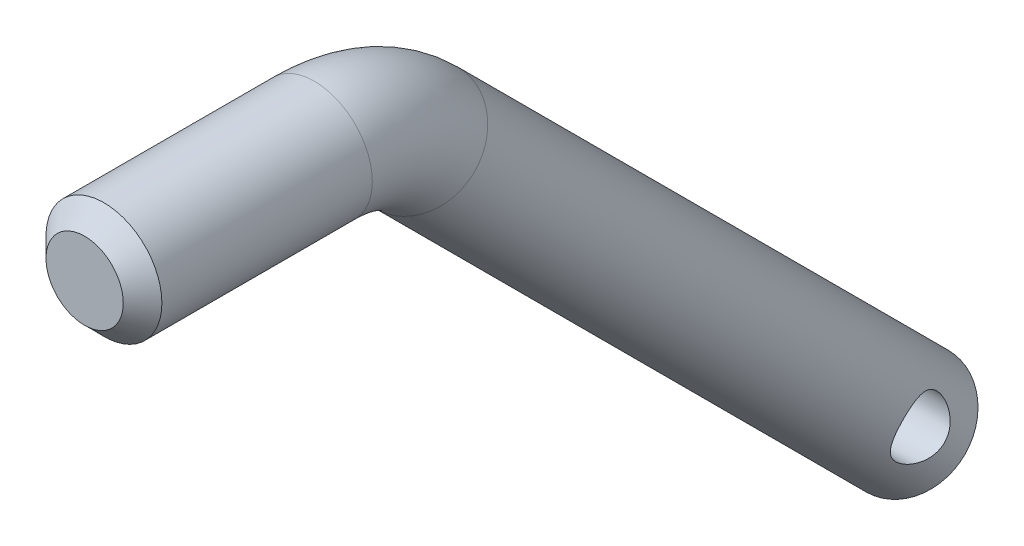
ISO-10303-21;
HEADER;
FILE_DESCRIPTION(('STEP AP214'),'2;1');
FILE_NAME('part.step','',(''),(''),'','','');
FILE_SCHEMA(('AUTOMOTIVE_DESIGN { 1 0 10303 214 1 1 1 1 }'));
ENDSEC;
DATA;
#1=APPLICATION_CONTEXT('core data for automotive mechanical design processes');
#2=APPLICATION_PROTOCOL_DEFINITION('international standard','automotive_design',2000,#1);
#3=PRODUCT_CONTEXT('',#1,'mechanical');
#4=PRODUCT('Part','Part','',(#3));
#5=PRODUCT_RELATED_PRODUCT_CATEGORY('part','',(#4));
#6=PRODUCT_DEFINITION_FORMATION('','',#4);
#7=PRODUCT_DEFINITION_CONTEXT('part definition',#1,'design');
#8=PRODUCT_DEFINITION('design','',#6,#7);
#9=PRODUCT_DEFINITION_SHAPE('','',#8);
#10=(LENGTH_UNIT() NAMED_UNIT(*) SI_UNIT(.MILLI.,.METRE.));
#11=(NAMED_UNIT(*) PLANE_ANGLE_UNIT() SI_UNIT($,.RADIAN.));
#12=(NAMED_UNIT(*) SI_UNIT($,.STERADIAN.) SOLID_ANGLE_UNIT());
#13=UNCERTAINTY_MEASURE_WITH_UNIT(LENGTH_MEASURE(1.E-05),#10,'distance_accuracy_value','');
#14=(GEOMETRIC_REPRESENTATION_CONTEXT(3) GLOBAL_UNCERTAINTY_ASSIGNED_CONTEXT((#13)) GLOBAL_UNIT_ASSIGNED_CONTEXT((#10,
#11,#12)) REPRESENTATION_CONTEXT('',''));
#15=CARTESIAN_POINT('',(0.,0.,0.));
#16=DIRECTION('',(0.,0.,1.));
#17=DIRECTION('',(1.,0.,0.));
#18=AXIS2_PLACEMENT_3D('',#15,#16,#17);
#19=CARTESIAN_POINT('',(0.,-4.39339828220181,-34.3933982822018));
#20=DIRECTION('',(0.,-0.707106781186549,-0.707106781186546));
#21=DIRECTION('',(0.,0.707106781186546,-0.707106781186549));
#22=AXIS2_PLACEMENT_3D('',#19,#20,#21);
#23=CYLINDRICAL_SURFACE('',#22,6.);
#24=CARTESIAN_POINT('',(-5.61248608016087,-50.9116882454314,-83.9116882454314));
#25=CARTESIAN_POINT('',(-5.56800915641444,-50.7452780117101,-83.9116858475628));
#26=CARTESIAN_POINT('',(-5.52298636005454,-50.5788502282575,-83.897831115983));
#27=CARTESIAN_POINT('',(-5.43657178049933,-50.2493962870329,-83.8424462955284));
#28=CARTESIAN_POINT('',(-5.39518680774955,-50.0863769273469,-83.8008654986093));
#29=CARTESIAN_POINT('',(-5.32094594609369,-49.7670443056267,-83.6898980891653));
#30=CARTESIAN_POINT('',(-5.28812794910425,-49.6107633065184,-83.6203912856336));
#31=CARTESIAN_POINT('',(-5.23616223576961,-49.3107713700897,-83.4545863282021));
#32=CARTESIAN_POINT('',(-5.21699214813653,-49.1670402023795,-83.3583323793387));
#33=CARTESIAN_POINT('',(-5.19653028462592,-48.9097269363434,-83.1515309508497));
#34=CARTESIAN_POINT('',(-5.19378205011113,-48.7945948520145,-83.043055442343));
#35=CARTESIAN_POINT('',(-5.20269225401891,-48.5830714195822,-82.8096709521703));
#36=CARTESIAN_POINT('',(-5.2143509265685,-48.4866803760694,-82.6847617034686));
#37=CARTESIAN_POINT('',(-5.24911403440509,-48.320977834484,-82.4314358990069));
#38=CARTESIAN_POINT('',(-5.27141447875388,-48.2503014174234,-82.30379152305));
#39=CARTESIAN_POINT('',(-5.3244192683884,-48.1286385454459,-82.0411144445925));
#40=CARTESIAN_POINT('',(-5.35512618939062,-48.077658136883,-81.9060794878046));
#41=CARTESIAN_POINT('',(-5.42500703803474,-47.9919474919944,-81.6185612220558));
#42=CARTESIAN_POINT('',(-5.4647031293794,-47.9591724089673,-81.4656240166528));
#43=CARTESIAN_POINT('',(-5.54650132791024,-47.9176898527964,-81.1571075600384));
#44=CARTESIAN_POINT('',(-5.5886049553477,-47.9089977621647,-81.0015266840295));
#45=CARTESIAN_POINT('',(-5.67594322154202,-47.9161900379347,-80.6734679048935));
#46=CARTESIAN_POINT('',(-5.72101814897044,-47.9348598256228,-80.5009988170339));
#47=CARTESIAN_POINT('',(-5.8046239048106,-48.0021270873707,-80.160302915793));
#48=CARTESIAN_POINT('',(-5.84315550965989,-48.0507210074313,-79.9920756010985));
#49=CARTESIAN_POINT('',(-5.90863725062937,-48.1760397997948,-79.6684533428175));
#50=CARTESIAN_POINT('',(-5.93582886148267,-48.2521058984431,-79.5128546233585));
#51=CARTESIAN_POINT('',(-5.976664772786,-48.430914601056,-79.215890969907));
#52=CARTESIAN_POINT('',(-5.99032093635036,-48.5336337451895,-79.0745136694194));
#53=CARTESIAN_POINT('',(-6.00181964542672,-48.7509346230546,-78.8246405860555));
#54=CARTESIAN_POINT('',(-6.00111142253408,-48.8632919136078,-78.7142688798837));
#55=CARTESIAN_POINT('',(-5.98748453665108,-49.1034372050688,-78.5127752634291));
#56=CARTESIAN_POINT('',(-5.97456717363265,-49.2312235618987,-78.4216513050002));
#57=CARTESIAN_POINT('',(-5.93841748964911,-49.4939533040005,-78.2635171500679));
#58=CARTESIAN_POINT('',(-5.91552482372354,-49.6285418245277,-78.1958346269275));
#59=CARTESIAN_POINT('',(-5.8615609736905,-49.9048634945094,-78.0817297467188));
#60=CARTESIAN_POINT('',(-5.83048800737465,-50.0465981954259,-78.0353120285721));
#61=CARTESIAN_POINT('',(-5.76026829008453,-50.3444348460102,-77.9615297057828));
#62=CARTESIAN_POINT('',(-5.72070096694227,-50.5008359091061,-77.9357800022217));
#63=CARTESIAN_POINT('',(-5.63861733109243,-50.8150365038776,-77.9090983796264));
#64=CARTESIAN_POINT('',(-5.59609896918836,-50.9728369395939,-77.9081838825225));
#65=CARTESIAN_POINT('',(-5.50803785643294,-51.3015042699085,-77.932145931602));
#66=CARTESIAN_POINT('',(-5.46258113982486,-51.4722229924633,-77.9594266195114));
#67=CARTESIAN_POINT('',(-5.37808394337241,-51.8080885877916,-78.0435254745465));
#68=CARTESIAN_POINT('',(-5.33904289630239,-51.9732359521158,-78.1003410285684));
#69=CARTESIAN_POINT('',(-5.28973228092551,-52.2115139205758,-78.2065338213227));
#70=CARTESIAN_POINT('',(-5.27493057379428,-52.2887101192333,-78.2449876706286));
#71=CARTESIAN_POINT('',(-5.24876772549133,-52.4399261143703,-78.3286777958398));
#72=CARTESIAN_POINT('',(-5.2374047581,-52.5139475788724,-78.3739104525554));
#73=CARTESIAN_POINT('',(-5.21861863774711,-52.6580632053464,-78.4708469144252));
#74=CARTESIAN_POINT('',(-5.21119183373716,-52.728160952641,-78.5225446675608));
#75=CARTESIAN_POINT('',(-5.20059284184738,-52.8637639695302,-78.631994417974));
#76=CARTESIAN_POINT('',(-5.19742004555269,-52.9292698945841,-78.6897455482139));
#77=CARTESIAN_POINT('',(-5.19480420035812,-53.1019756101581,-78.8560129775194));
#78=CARTESIAN_POINT('',(-5.19990579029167,-53.2038468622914,-78.9702751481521));
#79=CARTESIAN_POINT('',(-5.22295685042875,-53.3884667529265,-79.2120522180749));
#80=CARTESIAN_POINT('',(-5.24090904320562,-53.4712113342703,-79.3395699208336));
#81=CARTESIAN_POINT('',(-5.28669122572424,-53.6142282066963,-79.6009773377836));
#82=CARTESIAN_POINT('',(-5.31428138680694,-53.6749790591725,-79.734649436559));
#83=CARTESIAN_POINT('',(-5.37637381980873,-53.7760389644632,-80.0079457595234));
#84=CARTESIAN_POINT('',(-5.41087850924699,-53.816340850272,-80.1475720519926));
#85=CARTESIAN_POINT('',(-5.48786104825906,-53.8798504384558,-80.4468482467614));
#86=CARTESIAN_POINT('',(-5.530799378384,-53.9004961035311,-80.6069246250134));
#87=CARTESIAN_POINT('',(-5.61698672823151,-53.9159575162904,-80.9283085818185));
#88=CARTESIAN_POINT('',(-5.66023592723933,-53.9107569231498,-81.089616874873));
#89=CARTESIAN_POINT('',(-5.74636982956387,-53.8728644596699,-81.4234338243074));
#90=CARTESIAN_POINT('',(-5.78893714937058,-53.8379651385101,-81.5957830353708));
#91=CARTESIAN_POINT('',(-5.86495840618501,-53.7377774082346,-81.9335491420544));
#92=CARTESIAN_POINT('',(-5.89841693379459,-53.6725043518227,-82.098969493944));
#93=CARTESIAN_POINT('',(-5.95072289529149,-53.5171912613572,-82.4081962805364));
#94=CARTESIAN_POINT('',(-5.97029953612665,-53.4287902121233,-82.552698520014));
#95=CARTESIAN_POINT('',(-5.99558015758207,-53.2281882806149,-82.8254341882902));
#96=CARTESIAN_POINT('',(-6.0012947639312,-53.1160056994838,-82.9536800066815));
#97=CARTESIAN_POINT('',(-5.99834900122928,-52.8832072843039,-83.1781342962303));
#98=CARTESIAN_POINT('',(-5.99098892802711,-52.7643744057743,-83.2762208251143));
#99=CARTESIAN_POINT('',(-5.96509461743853,-52.5139080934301,-83.4526244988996));
#100=CARTESIAN_POINT('',(-5.94655669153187,-52.3822704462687,-83.5309351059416));
#101=CARTESIAN_POINT('',(-5.90006065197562,-52.1101035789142,-83.6661228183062));
#102=CARTESIAN_POINT('',(-5.87210525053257,-51.9695769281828,-83.7230060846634));
#103=CARTESIAN_POINT('',(-5.80922706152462,-51.683155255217,-83.8146908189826));
#104=CARTESIAN_POINT('',(-5.77431103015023,-51.5372655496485,-83.8495135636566));
#105=CARTESIAN_POINT('',(-5.71741888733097,-51.3109105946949,-83.886093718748));
#106=CARTESIAN_POINT('',(-5.69688940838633,-51.2312589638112,-83.8956932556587));
#107=CARTESIAN_POINT('',(-5.65511066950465,-51.0716356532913,-83.9084910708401));
#108=CARTESIAN_POINT('',(-5.6338614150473,-50.9916639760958,-83.9116893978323));
#109=CARTESIAN_POINT('',(-5.61248608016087,-50.9116882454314,-83.9116882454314));
#110=B_SPLINE_CURVE_WITH_KNOTS('',3,(#24,#25,#26,#27,#28,#29,#30,#31,#32,#33,#34,#35,#36,#37,
#38,#39,#40,#41,#42,#43,#44,#45,#46,#47,#48,#49,#50,#51,#52,#53,#54,#55,#56,#57,#58,#59,#60,#61,
#62,#63,#64,#65,#66,#67,#68,#69,#70,#71,#72,#73,#74,#75,#76,#77,#78,#79,#80,#81,#82,#83,#84,#85,
#86,#87,#88,#89,#90,#91,#92,#93,#94,#95,#96,#97,#98,#99,#100,#101,#102,#103,#104,#105,#106,#107,
#108,#109),.UNSPECIFIED.,.T.,.F.,(4,2,2,2,2,2,2,2,2,2,2,2,2,2,2,2,2,2,2,2,2,2,2,2,2,2,2,2,2,2,2,
2,2,2,2,2,2,2,2,2,2,2,4),(0.,0.516474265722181,1.03389570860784,1.55356835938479,
2.07238720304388,2.5444156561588,3.01645178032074,3.45741403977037,3.89851156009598,
4.38068183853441,4.86316002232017,5.39828877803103,5.93335399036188,6.45635858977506,
6.9789043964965,7.44901855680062,7.91908266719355,8.37425881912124,8.82953422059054,
9.31763273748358,9.80607364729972,10.3398956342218,10.8736703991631,11.1358633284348,
11.3979167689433,11.659726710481,11.9214992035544,12.3784468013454,12.8354912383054,
13.2818895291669,13.7284441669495,14.2274194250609,14.7267101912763,15.2667204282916,
15.8064580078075,16.3151761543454,16.8235042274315,17.2840669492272,17.7447817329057,
18.2053639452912,18.6655012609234,18.9137174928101,19.1619318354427),.UNSPECIFIED.);
#111=CARTESIAN_POINT('',(-5.61248608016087,-50.9116882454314,-83.9116882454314));
#112=VERTEX_POINT('',#111);
#113=EDGE_CURVE('E31',#112,#112,#110,.T.);
#114=ORIENTED_EDGE('',*,*,#113,.T.);
#115=EDGE_LOOP('',(#114));
#116=FACE_BOUND('',#115,.T.);
#117=CARTESIAN_POINT('',(5.61248608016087,-50.9116882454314,-83.9116882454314));
#118=CARTESIAN_POINT('',(5.65646371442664,-51.07624771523,-83.9116850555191));
#119=CARTESIAN_POINT('',(5.69998667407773,-51.2410879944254,-83.8981357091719));
#120=CARTESIAN_POINT('',(5.78185000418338,-51.5677675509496,-83.8437567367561));
#121=CARTESIAN_POINT('',(5.82018299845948,-51.7296022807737,-83.8028887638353));
#122=CARTESIAN_POINT('',(5.88788660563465,-52.0465806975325,-83.6938065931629));
#123=CARTESIAN_POINT('',(5.91722380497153,-52.2016976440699,-83.6254925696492));
#124=CARTESIAN_POINT('',(5.96347847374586,-52.4994800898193,-83.4626973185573));
#125=CARTESIAN_POINT('',(5.9804085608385,-52.6421581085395,-83.3682428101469));
#126=CARTESIAN_POINT('',(5.99918031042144,-52.9001464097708,-83.1636077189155));
#127=CARTESIAN_POINT('',(6.00203294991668,-53.016694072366,-83.055077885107));
#128=CARTESIAN_POINT('',(5.99509273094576,-53.2309653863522,-82.8211642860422));
#129=CARTESIAN_POINT('',(5.98530107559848,-53.328690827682,-82.6957821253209));
#130=CARTESIAN_POINT('',(5.95480972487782,-53.4986825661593,-82.4381929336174));
#131=CARTESIAN_POINT('',(5.93461985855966,-53.5718954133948,-82.3065455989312));
#132=CARTESIAN_POINT('',(5.88547998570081,-53.6973827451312,-82.0351944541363));
#133=CARTESIAN_POINT('',(5.85652842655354,-53.749653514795,-81.8954892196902));
#134=CARTESIAN_POINT('',(5.79031956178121,-53.8352637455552,-81.6026201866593));
#135=CARTESIAN_POINT('',(5.75266381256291,-53.8672564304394,-81.4491549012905));
#136=CARTESIAN_POINT('',(5.6735084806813,-53.9070443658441,-81.1400544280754));
#137=CARTESIAN_POINT('',(5.63200652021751,-53.9148245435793,-80.9844179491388));
#138=CARTESIAN_POINT('',(5.54470498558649,-53.9058626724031,-80.6586897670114));
#139=CARTESIAN_POINT('',(5.49888127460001,-53.8866533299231,-80.4886696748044));
#140=CARTESIAN_POINT('',(5.41205702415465,-53.8192008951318,-80.1529895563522));
#141=CARTESIAN_POINT('',(5.37105753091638,-53.7709515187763,-79.9873304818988));
#142=CARTESIAN_POINT('',(5.31718564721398,-53.6770509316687,-79.745363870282));
#143=CARTESIAN_POINT('',(5.30047453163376,-53.642073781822,-79.6656465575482));
#144=CARTESIAN_POINT('',(5.27025825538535,-53.5650464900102,-79.5090882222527));
#145=CARTESIAN_POINT('',(5.25675143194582,-53.52300003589,-79.4322457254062));
#146=CARTESIAN_POINT('',(5.2335223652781,-53.432097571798,-79.282201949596));
#147=CARTESIAN_POINT('',(5.22379633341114,-53.3832484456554,-79.2089970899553));
#148=CARTESIAN_POINT('',(5.20855338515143,-53.2790662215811,-79.0668905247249));
#149=CARTESIAN_POINT('',(5.20303580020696,-53.2237341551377,-78.9979881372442));
#150=CARTESIAN_POINT('',(5.19687538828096,-53.1142616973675,-78.8733851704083));
#151=CARTESIAN_POINT('',(5.19571687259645,-53.0608103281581,-78.8171027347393));
#152=CARTESIAN_POINT('',(5.1968805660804,-52.9497053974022,-78.7088483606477));
#153=CARTESIAN_POINT('',(5.1992039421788,-52.8920504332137,-78.6568778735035));
#154=CARTESIAN_POINT('',(5.20724681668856,-52.7730467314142,-78.5576829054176));
#155=CARTESIAN_POINT('',(5.21296519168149,-52.7116992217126,-78.5104568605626));
#156=CARTESIAN_POINT('',(5.2275826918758,-52.5857896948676,-78.4210342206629));
#157=CARTESIAN_POINT('',(5.23648306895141,-52.5212264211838,-78.3788396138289));
#158=CARTESIAN_POINT('',(5.26653126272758,-52.3297394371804,-78.2639485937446));
#159=CARTESIAN_POINT('',(5.29147844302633,-52.1991869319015,-78.1981462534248));
#160=CARTESIAN_POINT('',(5.34904323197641,-51.9314958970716,-78.0866078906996));
#161=CARTESIAN_POINT('',(5.38166331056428,-51.79435525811,-78.0408783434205));
#162=CARTESIAN_POINT('',(5.45517762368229,-51.5011538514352,-77.9658790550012));
#163=CARTESIAN_POINT('',(5.49658345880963,-51.3446366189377,-77.938888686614));
#164=CARTESIAN_POINT('',(5.58080936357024,-51.029628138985,-77.9098311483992));
#165=CARTESIAN_POINT('',(5.62363033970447,-50.8711356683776,-77.9077802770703));
#166=CARTESIAN_POINT('',(5.710795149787,-50.5397373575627,-77.9297735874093));
#167=CARTESIAN_POINT('',(5.75488422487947,-50.3669236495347,-77.9563666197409));
#168=CARTESIAN_POINT('',(5.83522828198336,-50.0268264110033,-78.0398177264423));
#169=CARTESIAN_POINT('',(5.87148575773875,-49.8595411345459,-78.0966661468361));
#170=CARTESIAN_POINT('',(5.93077508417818,-49.5423076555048,-78.2370603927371));
#171=CARTESIAN_POINT('',(5.95428404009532,-49.3919313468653,-78.3194288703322));
#172=CARTESIAN_POINT('',(5.98750870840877,-49.1064740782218,-78.5094939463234));
#173=CARTESIAN_POINT('',(5.99723553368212,-48.9713808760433,-78.6171700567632));
#174=CARTESIAN_POINT('',(6.00151908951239,-48.733923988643,-78.8425191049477));
#175=CARTESIAN_POINT('',(5.99747698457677,-48.6296465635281,-78.9581596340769));
#176=CARTESIAN_POINT('',(5.97768148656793,-48.4406292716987,-79.2035185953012));
#177=CARTESIAN_POINT('',(5.96192848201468,-48.3558887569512,-79.3332365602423));
#178=CARTESIAN_POINT('',(5.92059709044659,-48.2091240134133,-79.6005695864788));
#179=CARTESIAN_POINT('',(5.89518624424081,-48.1467458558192,-79.7380176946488));
#180=CARTESIAN_POINT('',(5.83676182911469,-48.0435949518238,-80.019224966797));
#181=CARTESIAN_POINT('',(5.80374632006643,-48.0028277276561,-80.1629857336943));
#182=CARTESIAN_POINT('',(5.72991024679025,-47.940700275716,-80.4655985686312));
#183=CARTESIAN_POINT('',(5.68867331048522,-47.921187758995,-80.6247271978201));
#184=CARTESIAN_POINT('',(5.60419182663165,-47.9076112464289,-80.943618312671));
#185=CARTESIAN_POINT('',(5.56094578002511,-47.9135665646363,-81.1033811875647));
#186=CARTESIAN_POINT('',(5.47289426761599,-47.9524446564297,-81.4341303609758));
#187=CARTESIAN_POINT('',(5.42827313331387,-47.9876363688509,-81.6049041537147));
#188=CARTESIAN_POINT('',(5.34702608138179,-48.0879040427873,-81.9396290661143));
#189=CARTESIAN_POINT('',(5.31039693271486,-48.1529678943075,-82.1035829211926));
#190=CARTESIAN_POINT('',(5.26615648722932,-48.270642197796,-82.337211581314));
#191=CARTESIAN_POINT('',(5.25335378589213,-48.3121756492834,-82.4116342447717));
#192=CARTESIAN_POINT('',(5.23135280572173,-48.4016888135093,-82.5570382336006));
#193=CARTESIAN_POINT('',(5.22215260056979,-48.4496650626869,-82.6280213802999));
#194=CARTESIAN_POINT('',(5.20776520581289,-48.5517004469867,-82.7658186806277));
#195=CARTESIAN_POINT('',(5.20257461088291,-48.6057543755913,-82.8326363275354));
#196=CARTESIAN_POINT('',(5.19641948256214,-48.7194819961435,-82.9614750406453));
#197=CARTESIAN_POINT('',(5.19545443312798,-48.7791550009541,-83.0234966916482));
#198=CARTESIAN_POINT('',(5.19871706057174,-48.9501785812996,-83.1865518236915));
#199=CARTESIAN_POINT('',(5.20736640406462,-49.0668105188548,-83.2820845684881));
#200=CARTESIAN_POINT('',(5.23666293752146,-49.3119955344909,-83.4540238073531));
#201=CARTESIAN_POINT('',(5.25731734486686,-49.4405557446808,-83.5304187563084));
#202=CARTESIAN_POINT('',(5.30802497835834,-49.7061041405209,-83.6627983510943));
#203=CARTESIAN_POINT('',(5.33808592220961,-49.8430991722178,-83.7187661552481));
#204=CARTESIAN_POINT('',(5.40435625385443,-50.1222941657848,-83.8096869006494));
#205=CARTESIAN_POINT('',(5.44055997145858,-50.2644892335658,-83.844659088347));
#206=CARTESIAN_POINT('',(5.50000970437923,-50.4913137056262,-83.8832926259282));
#207=CARTESIAN_POINT('',(5.52232029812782,-50.5750682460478,-83.8939344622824));
#208=CARTESIAN_POINT('',(5.56728907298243,-50.743086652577,-83.9081334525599));
#209=CARTESIAN_POINT('',(5.58994728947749,-50.8273505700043,-83.9116898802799));
#210=CARTESIAN_POINT('',(5.61248608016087,-50.9116882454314,-83.9116882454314));
#211=B_SPLINE_CURVE_WITH_KNOTS('',3,(#117,#118,#119,#120,#121,#122,#123,#124,#125,#126,#127,
#128,#129,#130,#131,#132,#133,#134,#135,#136,#137,#138,#139,#140,#141,#142,#143,#144,#145,#146,
#147,#148,#149,#150,#151,#152,#153,#154,#155,#156,#157,#158,#159,#160,#161,#162,#163,#164,#165,
#166,#167,#168,#169,#170,#171,#172,#173,#174,#175,#176,#177,#178,#179,#180,#181,#182,#183,#184,
#185,#186,#187,#188,#189,#190,#191,#192,#193,#194,#195,#196,#197,#198,#199,#200,#201,#202,#203,
#204,#205,#206,#207,#208,#209,#210),.UNSPECIFIED.,.T.,.F.,(4,2,2,2,2,2,2,2,2,2,2,2,2,2,2,2,2,2,
2,2,2,2,2,2,2,2,2,2,2,2,2,2,2,2,2,2,2,2,2,2,2,2,2,2,2,2,4),(0.,0.510710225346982,
1.02213883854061,1.53544468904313,2.04822779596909,2.52358820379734,2.99890338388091,
3.45286409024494,3.90690528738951,4.38859754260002,4.87058960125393,5.39962060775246,
5.92876613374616,6.19437496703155,6.45984566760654,6.72504965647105,6.99021150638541,
7.22279093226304,7.45544832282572,7.68802876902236,7.92070081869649,8.36363519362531,
8.80671234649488,9.29710782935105,9.78782377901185,10.3261083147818,10.8642211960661,
11.3804913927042,11.8963450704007,12.361337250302,12.8263140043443,13.2835677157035,
13.7409382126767,14.2355010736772,14.7304390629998,15.2678231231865,15.8049895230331,
16.0632237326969,16.321319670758,16.5791961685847,16.8370411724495,17.2876593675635,
17.7385487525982,18.1898090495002,18.640655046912,18.902370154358,19.1641120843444),.UNSPECIFIED.);
#212=CARTESIAN_POINT('',(5.61248608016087,-50.9116882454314,-83.9116882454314));
#213=VERTEX_POINT('',#212);
#214=EDGE_CURVE('E46',#213,#213,#211,.T.);
#215=ORIENTED_EDGE('',*,*,#214,.T.);
#216=EDGE_LOOP('',(#215));
#217=FACE_BOUND('',#216,.T.);
#218=CARTESIAN_POINT('',(0.,-55.1543289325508,-85.1543289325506));
#219=DIRECTION('',(0.,0.707106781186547,0.707106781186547));
#220=DIRECTION('',(0.,-0.707106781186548,0.707106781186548));
#221=AXIS2_PLACEMENT_3D('',#218,#219,#220);
#222=CIRCLE('',#221,6.);
#223=CARTESIAN_POINT('',(0.,-59.3969696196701,-80.9116882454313));
#224=VERTEX_POINT('',#223);
#225=EDGE_CURVE('E89',#224,#224,#222,.T.);
#226=ORIENTED_EDGE('',*,*,#225,.T.);
#227=EDGE_LOOP('',(#226));
#228=FACE_BOUND('',#227,.T.);
#229=CARTESIAN_POINT('',(0.,-4.39339828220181,-34.3933982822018));
#230=DIRECTION('',(0.,0.707106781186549,0.707106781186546));
#231=DIRECTION('',(1.,0.,0.));
#232=AXIS2_PLACEMENT_3D('',#229,#230,#231);
#233=CIRCLE('',#232,6.);
#234=CARTESIAN_POINT('',(0.,-0.15075759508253,-38.6360389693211));
#235=VERTEX_POINT('',#234);
#236=EDGE_CURVE('E87',#235,#235,#233,.T.);
#237=ORIENTED_EDGE('',*,*,#236,.F.);
#238=EDGE_LOOP('',(#237));
#239=FACE_BOUND('',#238,.T.);
#240=ADVANCED_FACE('F27',(#116,#217,#228,#239),#23,.T.);
#241=CARTESIAN_POINT('',(0.,-15.,-23.7867965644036));
#242=DIRECTION('',(-1.,0.,0.));
#243=DIRECTION('',(0.,0.,1.));
#244=AXIS2_PLACEMENT_3D('',#241,#242,#243);
#245=TOROIDAL_SURFACE('',#244,15.,6.);
#246=CARTESIAN_POINT('',(0.,0.,-23.7867965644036));
#247=DIRECTION('',(0.,0.,1.));
#248=DIRECTION('',(1.,0.,0.));
#249=AXIS2_PLACEMENT_3D('',#246,#247,#248);
#250=CIRCLE('',#249,6.);
#251=CARTESIAN_POINT('',(0.,6.,-23.7867965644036));
#252=VERTEX_POINT('',#251);
#253=EDGE_CURVE('E84',#252,#252,#250,.T.);
#254=CARTESIAN_POINT('',(0.,-15.,-23.7867965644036));
#255=DIRECTION('',(-1.,0.,0.));
#256=DIRECTION('',(0.,0.,1.));
#257=AXIS2_PLACEMENT_3D('',#254,#255,#256);
#258=CIRCLE('',#257,21.);
#259=EDGE_CURVE('',#252,#235,#258,.T.);
#260=ORIENTED_EDGE('',*,*,#253,.F.);
#261=ORIENTED_EDGE('',*,*,#236,.T.);
#262=ORIENTED_EDGE('',*,*,#259,.T.);
#263=ORIENTED_EDGE('',*,*,#259,.F.);
#264=EDGE_LOOP('',(#260,#262,#261,#263));
#265=FACE_BOUND('',#264,.T.);
#266=ADVANCED_FACE('F74',(#265),#245,.T.);
#267=CARTESIAN_POINT('',(0.,0.,-23.7867965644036));
#268=DIRECTION('',(0.,0.,1.));
#269=DIRECTION('',(1.,0.,0.));
#270=AXIS2_PLACEMENT_3D('',#267,#268,#269);
#271=CYLINDRICAL_SURFACE('',#270,6.);
#272=CARTESIAN_POINT('',(0.,0.,-2.00000000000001));
#273=DIRECTION('',(0.,0.,1.));
#274=DIRECTION('',(1.,0.,0.));
#275=AXIS2_PLACEMENT_3D('',#272,#273,#274);
#276=CIRCLE('',#275,6.);
#277=CARTESIAN_POINT('',(6.,0.,-2.00000000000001));
#278=VERTEX_POINT('',#277);
#279=EDGE_CURVE('E10',#278,#278,#276,.F.);
#280=ORIENTED_EDGE('',*,*,#279,.T.);
#281=EDGE_LOOP('',(#280));
#282=FACE_BOUND('',#281,.T.);
#283=ORIENTED_EDGE('',*,*,#253,.T.);
#284=EDGE_LOOP('',(#283));
#285=FACE_BOUND('',#284,.T.);
#286=ADVANCED_FACE('F71',(#282,#285),#271,.T.);
#287=CARTESIAN_POINT('',(0.,-56.5685424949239,-86.5685424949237));
#288=DIRECTION('',(0.,0.707106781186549,0.707106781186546));
#289=DIRECTION('',(1.,0.,0.));
#290=AXIS2_PLACEMENT_3D('',#287,#288,#289);
#291=PLANE('',#290);
#292=CARTESIAN_POINT('',(0.,-56.5685424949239,-86.5685424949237));
#293=DIRECTION('',(0.,0.707106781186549,0.707106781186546));
#294=DIRECTION('',(0.,-0.707106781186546,0.707106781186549));
#295=AXIS2_PLACEMENT_3D('',#292,#293,#294);
#296=CIRCLE('',#295,3.99999999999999);
#297=CARTESIAN_POINT('',(0.,-59.3969696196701,-83.7401153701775));
#298=VERTEX_POINT('',#297);
#299=EDGE_CURVE('E43',#298,#298,#296,.F.);
#300=ORIENTED_EDGE('',*,*,#299,.T.);
#301=EDGE_LOOP('',(#300));
#302=FACE_BOUND('',#301,.T.);
#303=ADVANCED_FACE('F67',(#302),#291,.F.);
#304=CARTESIAN_POINT('',(0.,0.,0.));
#305=DIRECTION('',(0.,0.,1.));
#306=DIRECTION('',(1.,0.,0.));
#307=AXIS2_PLACEMENT_3D('',#304,#305,#306);
#308=PLANE('',#307);
#309=CARTESIAN_POINT('',(0.,0.,0.));
#310=DIRECTION('',(0.,0.,1.));
#311=DIRECTION('',(1.,0.,0.));
#312=AXIS2_PLACEMENT_3D('',#309,#310,#311);
#313=CIRCLE('',#312,3.99999999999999);
#314=CARTESIAN_POINT('',(3.99999999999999,0.,0.));
#315=VERTEX_POINT('',#314);
#316=EDGE_CURVE('E38',#315,#315,#313,.T.);
#317=ORIENTED_EDGE('',*,*,#316,.T.);
#318=EDGE_LOOP('',(#317));
#319=FACE_BOUND('',#318,.T.);
#320=ADVANCED_FACE('F63',(#319),#308,.T.);
#321=CARTESIAN_POINT('',(0.,-55.1543289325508,-85.1543289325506));
#322=DIRECTION('',(0.,0.707106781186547,0.707106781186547));
#323=DIRECTION('',(0.,-0.707106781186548,0.707106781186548));
#324=AXIS2_PLACEMENT_3D('',#321,#322,#323);
#325=CONICAL_SURFACE('',#324,6.,0.785398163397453);
#326=CARTESIAN_POINT('',(0.,-59.3969696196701,-83.7401153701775));
#327=CARTESIAN_POINT('',(0.,-59.3969696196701,-83.7106525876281));
#328=CARTESIAN_POINT('',(0.,-59.3969696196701,-83.6811898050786));
#329=CARTESIAN_POINT('',(0.,-59.3969696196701,-83.6222642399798));
#330=CARTESIAN_POINT('',(0.,-59.3969696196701,-83.5928014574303));
#331=CARTESIAN_POINT('',(0.,-59.3969696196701,-83.5338758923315));
#332=CARTESIAN_POINT('',(0.,-59.3969696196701,-83.504413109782));
#333=CARTESIAN_POINT('',(0.,-59.3969696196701,-83.4454875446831));
#334=CARTESIAN_POINT('',(0.,-59.3969696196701,-83.4160247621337));
#335=CARTESIAN_POINT('',(0.,-59.3969696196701,-83.3570991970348));
#336=CARTESIAN_POINT('',(0.,-59.3969696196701,-83.3276364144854));
#337=CARTESIAN_POINT('',(0.,-59.3969696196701,-83.2687108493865));
#338=CARTESIAN_POINT('',(0.,-59.3969696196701,-83.239248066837));
#339=CARTESIAN_POINT('',(0.,-59.3969696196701,-83.1803225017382));
#340=CARTESIAN_POINT('',(0.,-59.3969696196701,-83.1508597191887));
#341=CARTESIAN_POINT('',(0.,-59.3969696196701,-83.0919341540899));
#342=CARTESIAN_POINT('',(0.,-59.3969696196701,-83.0624713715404));
#343=CARTESIAN_POINT('',(0.,-59.3969696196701,-83.0035458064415));
#344=CARTESIAN_POINT('',(0.,-59.3969696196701,-82.9740830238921));
#345=CARTESIAN_POINT('',(0.,-59.3969696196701,-82.9151574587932));
#346=CARTESIAN_POINT('',(0.,-59.3969696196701,-82.8856946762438));
#347=CARTESIAN_POINT('',(0.,-59.3969696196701,-82.8267691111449));
#348=CARTESIAN_POINT('',(0.,-59.3969696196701,-82.7973063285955));
#349=CARTESIAN_POINT('',(0.,-59.3969696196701,-82.7383807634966));
#350=CARTESIAN_POINT('',(0.,-59.3969696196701,-82.7089179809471));
#351=CARTESIAN_POINT('',(0.,-59.3969696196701,-82.6499924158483));
#352=CARTESIAN_POINT('',(0.,-59.3969696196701,-82.6205296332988));
#353=CARTESIAN_POINT('',(0.,-59.3969696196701,-82.5616040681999));
#354=CARTESIAN_POINT('',(0.,-59.3969696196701,-82.5321412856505));
#355=CARTESIAN_POINT('',(0.,-59.3969696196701,-82.4732157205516));
#356=CARTESIAN_POINT('',(0.,-59.3969696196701,-82.4437529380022));
#357=CARTESIAN_POINT('',(0.,-59.3969696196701,-82.3848273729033));
#358=CARTESIAN_POINT('',(0.,-59.3969696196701,-82.3553645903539));
#359=CARTESIAN_POINT('',(0.,-59.3969696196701,-82.296439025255));
#360=CARTESIAN_POINT('',(0.,-59.3969696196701,-82.2669762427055));
#361=CARTESIAN_POINT('',(0.,-59.3969696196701,-82.2080506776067));
#362=CARTESIAN_POINT('',(0.,-59.3969696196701,-82.1785878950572));
#363=CARTESIAN_POINT('',(0.,-59.3969696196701,-82.1196623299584));
#364=CARTESIAN_POINT('',(0.,-59.3969696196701,-82.0901995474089));
#365=CARTESIAN_POINT('',(0.,-59.3969696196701,-82.03127398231));
#366=CARTESIAN_POINT('',(0.,-59.3969696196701,-82.0018111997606));
#367=CARTESIAN_POINT('',(0.,-59.3969696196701,-81.9428856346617));
#368=CARTESIAN_POINT('',(0.,-59.3969696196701,-81.9134228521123));
#369=CARTESIAN_POINT('',(0.,-59.3969696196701,-81.8544972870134));
#370=CARTESIAN_POINT('',(0.,-59.3969696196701,-81.825034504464));
#371=CARTESIAN_POINT('',(0.,-59.3969696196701,-81.7661089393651));
#372=CARTESIAN_POINT('',(0.,-59.3969696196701,-81.7366461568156));
#373=CARTESIAN_POINT('',(0.,-59.3969696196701,-81.6777205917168));
#374=CARTESIAN_POINT('',(0.,-59.3969696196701,-81.6482578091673));
#375=CARTESIAN_POINT('',(0.,-59.3969696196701,-81.5893322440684));
#376=CARTESIAN_POINT('',(0.,-59.3969696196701,-81.559869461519));
#377=CARTESIAN_POINT('',(0.,-59.3969696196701,-81.5009438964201));
#378=CARTESIAN_POINT('',(0.,-59.3969696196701,-81.4714811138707));
#379=CARTESIAN_POINT('',(0.,-59.3969696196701,-81.4125555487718));
#380=CARTESIAN_POINT('',(0.,-59.3969696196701,-81.3830927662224));
#381=CARTESIAN_POINT('',(0.,-59.3969696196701,-81.3241672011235));
#382=CARTESIAN_POINT('',(0.,-59.3969696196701,-81.2947044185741));
#383=CARTESIAN_POINT('',(0.,-59.3969696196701,-81.2357788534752));
#384=CARTESIAN_POINT('',(0.,-59.3969696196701,-81.2063160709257));
#385=CARTESIAN_POINT('',(0.,-59.3969696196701,-81.1473905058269));
#386=CARTESIAN_POINT('',(0.,-59.3969696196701,-81.1179277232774));
#387=CARTESIAN_POINT('',(0.,-59.3969696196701,-81.0590021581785));
#388=CARTESIAN_POINT('',(0.,-59.3969696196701,-81.0295393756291));
#389=CARTESIAN_POINT('',(0.,-59.3969696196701,-80.9706138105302));
#390=CARTESIAN_POINT('',(0.,-59.3969696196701,-80.9411510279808));
#391=CARTESIAN_POINT('',(0.,-59.3969696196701,-80.9116882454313));
#392=B_SPLINE_CURVE_WITH_KNOTS('',3,(#326,#327,#328,#329,#330,#331,#332,#333,#334,#335,#336,
#337,#338,#339,#340,#341,#342,#343,#344,#345,#346,#347,#348,#349,#350,#351,#352,#353,#354,#355,
#356,#357,#358,#359,#360,#361,#362,#363,#364,#365,#366,#367,#368,#369,#370,#371,#372,#373,#374,
#375,#376,#377,#378,#379,#380,#381,#382,#383,#384,#385,#386,#387,#388,#389,#390,#391),
.UNSPECIFIED.,.F.,.F.,(4,2,2,2,2,2,2,2,2,2,2,2,2,2,2,2,2,2,2,2,2,2,2,2,2,2,2,2,2,2,2,2,4),(0.,
0.0883883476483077,0.176776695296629,0.265165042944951,0.353553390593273,0.441941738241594,
0.530330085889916,0.618718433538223,0.707106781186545,0.795495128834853,0.883883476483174,
0.972271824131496,1.06066017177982,1.14904851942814,1.23743686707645,1.32582521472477,
1.41421356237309,1.50260191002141,1.59099025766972,1.67937860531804,1.76776695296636,
1.85615530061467,1.94454364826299,2.03293199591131,2.12132034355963,2.20970869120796,
2.29809703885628,2.38648538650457,2.47487373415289,2.56326208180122,2.65165042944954,
2.74003877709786,2.82842712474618),.UNSPECIFIED.);
#393=EDGE_CURVE('BSEAM59',#298,#224,#392,.T.);
#394=ORIENTED_EDGE('',*,*,#299,.F.);
#395=ORIENTED_EDGE('',*,*,#225,.F.);
#396=ORIENTED_EDGE('',*,*,#393,.T.);
#397=ORIENTED_EDGE('',*,*,#393,.F.);
#398=EDGE_LOOP('',(#394,#396,#395,#397));
#399=FACE_BOUND('',#398,.T.);
#400=ADVANCED_FACE('F59',(#399),#325,.T.);
#401=CARTESIAN_POINT('',(0.,0.,0.));
#402=DIRECTION('',(0.,0.,-1.));
#403=DIRECTION('',(-1.,0.,0.));
#404=AXIS2_PLACEMENT_3D('',#401,#402,#403);
#405=CONICAL_SURFACE('',#404,3.99999999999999,0.785398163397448);
#406=ORIENTED_EDGE('',*,*,#279,.F.);
#407=EDGE_LOOP('',(#406));
#408=FACE_BOUND('',#407,.T.);
#409=ORIENTED_EDGE('',*,*,#316,.F.);
#410=EDGE_LOOP('',(#409));
#411=FACE_BOUND('',#410,.T.);
#412=ADVANCED_FACE('F54',(#408,#411),#405,.T.);
#413=CARTESIAN_POINT('',(-7.,-50.9116882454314,-80.9116882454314));
#414=DIRECTION('',(1.,0.,0.));
#415=DIRECTION('',(0.,0.,-1.));
#416=AXIS2_PLACEMENT_3D('',#413,#414,#415);
#417=CYLINDRICAL_SURFACE('',#416,3.00000000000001);
#418=ORIENTED_EDGE('',*,*,#214,.F.);
#419=EDGE_LOOP('',(#418));
#420=FACE_BOUND('',#419,.T.);
#421=ORIENTED_EDGE('',*,*,#113,.F.);
#422=EDGE_LOOP('',(#421));
#423=FACE_BOUND('',#422,.T.);
#424=ADVANCED_FACE('F50',(#420,#423),#417,.F.);
#425=CLOSED_SHELL('',(#240,#266,#286,#303,#320,#400,#412,#424));
#426=MANIFOLD_SOLID_BREP('B2',#425);
#427=ADVANCED_BREP_SHAPE_REPRESENTATION('',(#18,#426),#14);
#428=SHAPE_DEFINITION_REPRESENTATION(#9,#427);
ENDSEC;
END-ISO-10303-21;
